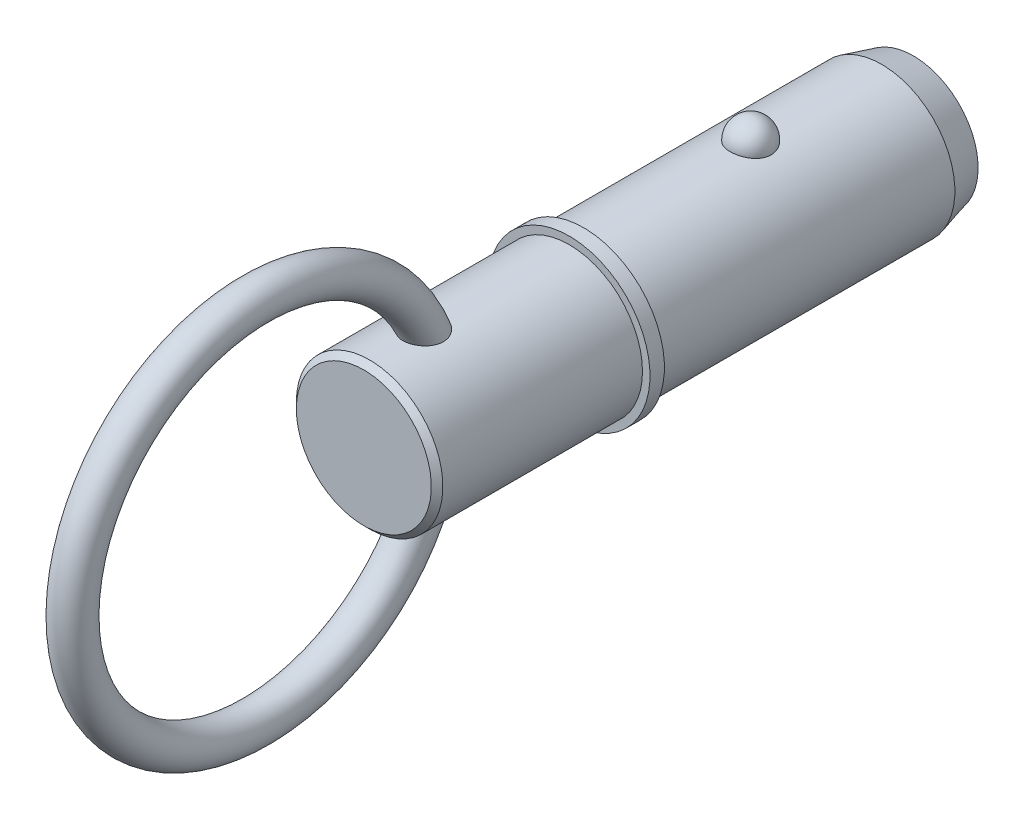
ISO-10303-21;
HEADER;
FILE_DESCRIPTION(('STEP AP214'),'2;1');
FILE_NAME('part.step','',(''),(''),'','','');
FILE_SCHEMA(('AUTOMOTIVE_DESIGN { 1 0 10303 214 1 1 1 1 }'));
ENDSEC;
DATA;
#1=APPLICATION_CONTEXT('core data for automotive mechanical design processes');
#2=APPLICATION_PROTOCOL_DEFINITION('international standard','automotive_design',2000,#1);
#3=PRODUCT_CONTEXT('',#1,'mechanical');
#4=PRODUCT('Part','Part','',(#3));
#5=PRODUCT_RELATED_PRODUCT_CATEGORY('part','',(#4));
#6=PRODUCT_DEFINITION_FORMATION('','',#4);
#7=PRODUCT_DEFINITION_CONTEXT('part definition',#1,'design');
#8=PRODUCT_DEFINITION('design','',#6,#7);
#9=PRODUCT_DEFINITION_SHAPE('','',#8);
#10=(LENGTH_UNIT() NAMED_UNIT(*) SI_UNIT(.MILLI.,.METRE.));
#11=(NAMED_UNIT(*) PLANE_ANGLE_UNIT() SI_UNIT($,.RADIAN.));
#12=(NAMED_UNIT(*) SI_UNIT($,.STERADIAN.) SOLID_ANGLE_UNIT());
#13=UNCERTAINTY_MEASURE_WITH_UNIT(LENGTH_MEASURE(1.E-05),#10,'distance_accuracy_value','');
#14=(GEOMETRIC_REPRESENTATION_CONTEXT(3) GLOBAL_UNCERTAINTY_ASSIGNED_CONTEXT((#13)) GLOBAL_UNIT_ASSIGNED_CONTEXT((#10,
#11,#12)) REPRESENTATION_CONTEXT('',''));
#15=CARTESIAN_POINT('',(0.,0.,0.));
#16=DIRECTION('',(0.,0.,1.));
#17=DIRECTION('',(1.,0.,0.));
#18=AXIS2_PLACEMENT_3D('',#15,#16,#17);
#19=CARTESIAN_POINT('',(0.,0.,25.4));
#20=DIRECTION('',(0.,0.,-1.));
#21=DIRECTION('',(-1.,0.,0.));
#22=AXIS2_PLACEMENT_3D('',#19,#20,#21);
#23=CYLINDRICAL_SURFACE('',#22,12.7);
#24=CARTESIAN_POINT('',(3.52486003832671,12.2010393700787,-3.56));
#25=CARTESIAN_POINT('',(3.52485671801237,12.2010422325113,-3.3610062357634));
#26=CARTESIAN_POINT('',(3.50863187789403,12.2057632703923,-3.16197042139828));
#27=CARTESIAN_POINT('',(3.4441205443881,12.2241207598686,-2.76953945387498));
#28=CARTESIAN_POINT('',(3.39582213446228,12.2377605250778,-2.57614642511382));
#29=CARTESIAN_POINT('',(3.26839193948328,12.2724057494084,-2.20059799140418));
#30=CARTESIAN_POINT('',(3.18927369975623,12.2934079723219,-2.01843769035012));
#31=CARTESIAN_POINT('',(3.00217139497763,12.3404306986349,-1.6703228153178));
#32=CARTESIAN_POINT('',(2.89418796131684,12.3664510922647,-1.50436788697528));
#33=CARTESIAN_POINT('',(2.65144862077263,12.4207616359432,-1.19241975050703));
#34=CARTESIAN_POINT('',(2.51656310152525,12.4490623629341,-1.04652919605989));
#35=CARTESIAN_POINT('',(2.22383249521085,12.5046678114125,-0.779711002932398));
#36=CARTESIAN_POINT('',(2.0659873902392,12.5319725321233,-0.658783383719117));
#37=CARTESIAN_POINT('',(1.73204520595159,12.5824645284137,-0.445586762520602));
#38=CARTESIAN_POINT('',(1.55600183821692,12.6056634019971,-0.353236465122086));
#39=CARTESIAN_POINT('',(1.19021695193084,12.6454411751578,-0.199381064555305));
#40=CARTESIAN_POINT('',(1.00047694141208,12.6620208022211,-0.137872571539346));
#41=CARTESIAN_POINT('',(0.616329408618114,12.6864692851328,-0.0483191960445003));
#42=CARTESIAN_POINT('',(0.422067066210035,12.6944893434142,-0.0196927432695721));
#43=CARTESIAN_POINT('',(0.0313259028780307,12.7014637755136,0.00524116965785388));
#44=CARTESIAN_POINT('',(-0.165152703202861,12.7004190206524,0.00155173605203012));
#45=CARTESIAN_POINT('',(-0.551780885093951,12.6894611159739,-0.0377454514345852));
#46=CARTESIAN_POINT('',(-0.74198078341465,12.6796749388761,-0.0728962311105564));
#47=CARTESIAN_POINT('',(-1.11361063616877,12.6524544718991,-0.173489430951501));
#48=CARTESIAN_POINT('',(-1.29504043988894,12.6350200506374,-0.238932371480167));
#49=CARTESIAN_POINT('',(-1.64521311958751,12.5942270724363,-0.398772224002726));
#50=CARTESIAN_POINT('',(-1.81387645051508,12.5708347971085,-0.493334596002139));
#51=CARTESIAN_POINT('',(-2.13292959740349,12.5206522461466,-0.708731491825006));
#52=CARTESIAN_POINT('',(-2.28331755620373,12.4938616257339,-0.829568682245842));
#53=CARTESIAN_POINT('',(-2.56470285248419,12.4391828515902,-1.0968714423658));
#54=CARTESIAN_POINT('',(-2.69527522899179,12.4112835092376,-1.24378221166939));
#55=CARTESIAN_POINT('',(-2.93023079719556,12.3579248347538,-1.55763192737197));
#56=CARTESIAN_POINT('',(-3.03461212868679,12.3324656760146,-1.72457229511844));
#57=CARTESIAN_POINT('',(-3.21564423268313,12.2865167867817,-2.07598316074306));
#58=CARTESIAN_POINT('',(-3.29196222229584,12.2660875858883,-2.26063321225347));
#59=CARTESIAN_POINT('',(-3.41323771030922,12.2328979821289,-2.64061334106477));
#60=CARTESIAN_POINT('',(-3.45819611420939,12.2201373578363,-2.83594310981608));
#61=CARTESIAN_POINT('',(-3.51550038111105,12.2037762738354,-3.2308649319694));
#62=CARTESIAN_POINT('',(-3.5279827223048,12.200137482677,-3.43043558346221));
#63=CARTESIAN_POINT('',(-3.52041430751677,12.2023234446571,-3.8289025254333));
#64=CARTESIAN_POINT('',(-3.50036443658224,12.2081479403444,-4.02779883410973));
#65=CARTESIAN_POINT('',(-3.42842010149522,12.2285446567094,-4.41824213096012));
#66=CARTESIAN_POINT('',(-3.37668525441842,12.243073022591,-4.6098208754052));
#67=CARTESIAN_POINT('',(-3.24279085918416,12.2792134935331,-4.98132360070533));
#68=CARTESIAN_POINT('',(-3.16063009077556,12.300825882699,-5.16124711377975));
#69=CARTESIAN_POINT('',(-2.96738224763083,12.3488691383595,-5.50542856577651));
#70=CARTESIAN_POINT('',(-2.85613997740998,12.3753256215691,-5.66959579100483));
#71=CARTESIAN_POINT('',(-2.60773241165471,12.4300386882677,-5.97665065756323));
#72=CARTESIAN_POINT('',(-2.47056612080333,12.458295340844,-6.11953748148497));
#73=CARTESIAN_POINT('',(-2.17327999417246,12.5135827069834,-6.38059312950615));
#74=CARTESIAN_POINT('',(-2.01307652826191,12.5406084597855,-6.49866785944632));
#75=CARTESIAN_POINT('',(-1.67442544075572,12.5902954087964,-6.70609314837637));
#76=CARTESIAN_POINT('',(-1.49597909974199,12.6129569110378,-6.79544572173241));
#77=CARTESIAN_POINT('',(-1.12819666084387,12.6511224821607,-6.94192787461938));
#78=CARTESIAN_POINT('',(-0.93902400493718,12.666712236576,-6.99944518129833));
#79=CARTESIAN_POINT('',(-0.553267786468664,12.6894125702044,-7.08227444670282));
#80=CARTESIAN_POINT('',(-0.356685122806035,12.6965241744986,-7.10759029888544));
#81=CARTESIAN_POINT('',(0.0343320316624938,12.7014305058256,-7.12510946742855));
#82=CARTESIAN_POINT('',(0.228736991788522,12.6993986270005,-7.11792901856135));
#83=CARTESIAN_POINT('',(0.613493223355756,12.6866339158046,-7.07206766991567));
#84=CARTESIAN_POINT('',(0.803844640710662,12.6759013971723,-7.03338790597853));
#85=CARTESIAN_POINT('',(1.17440741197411,12.6469443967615,-6.925834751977));
#86=CARTESIAN_POINT('',(1.35465462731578,12.6287486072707,-6.85707692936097));
#87=CARTESIAN_POINT('',(1.70092526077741,12.5867908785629,-6.69128257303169));
#88=CARTESIAN_POINT('',(1.86694777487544,12.5630285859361,-6.59424424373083));
#89=CARTESIAN_POINT('',(2.18289085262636,12.5120350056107,-6.3727748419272));
#90=CARTESIAN_POINT('',(2.33252391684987,12.4847559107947,-6.24794475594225));
#91=CARTESIAN_POINT('',(2.60889724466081,12.4299457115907,-5.97511730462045));
#92=CARTESIAN_POINT('',(2.73563353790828,12.4024145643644,-5.82711592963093));
#93=CARTESIAN_POINT('',(2.96505559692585,12.3495984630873,-5.5091226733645));
#94=CARTESIAN_POINT('',(3.06728335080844,12.3243610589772,-5.33879227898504));
#95=CARTESIAN_POINT('',(3.24218794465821,12.2795120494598,-4.98295005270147));
#96=CARTESIAN_POINT('',(3.31487538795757,12.2598984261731,-4.79744369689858));
#97=CARTESIAN_POINT('',(3.42255689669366,12.2302435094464,-4.43775244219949));
#98=CARTESIAN_POINT('',(3.46085292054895,12.2193780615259,-4.264615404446));
#99=CARTESIAN_POINT('',(3.5120056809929,12.2047747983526,-3.9143299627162));
#100=CARTESIAN_POINT('',(3.52486299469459,12.2010368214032,-3.73718164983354));
#101=CARTESIAN_POINT('',(3.52486003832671,12.2010393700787,-3.56));
#102=B_SPLINE_CURVE_WITH_KNOTS('',3,(#24,#25,#26,#27,#28,#29,#30,#31,#32,#33,#34,#35,#36,#37,
#38,#39,#40,#41,#42,#43,#44,#45,#46,#47,#48,#49,#50,#51,#52,#53,#54,#55,#56,#57,#58,#59,#60,#61,
#62,#63,#64,#65,#66,#67,#68,#69,#70,#71,#72,#73,#74,#75,#76,#77,#78,#79,#80,#81,#82,#83,#84,#85,
#86,#87,#88,#89,#90,#91,#92,#93,#94,#95,#96,#97,#98,#99,#100,#101),.UNSPECIFIED.,.T.,.F.,(4,2,2,
2,2,2,2,2,2,2,2,2,2,2,2,2,2,2,2,2,2,2,2,2,2,2,2,2,2,2,2,2,2,2,2,2,2,2,4),(0.,0.596344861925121,
1.19291141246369,1.78921606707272,2.38550767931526,2.98474477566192,3.58398233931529,
4.18149920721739,4.77895038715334,5.36566361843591,5.95232045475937,6.53059198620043,
7.10887345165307,7.6905033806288,8.27219236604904,8.86498552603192,9.45782077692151,
10.0574751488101,10.6571122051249,11.2542252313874,11.8513220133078,12.4454353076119,
13.0395724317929,13.636947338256,14.2343451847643,14.8339691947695,15.4335511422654,
16.0256602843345,16.6176978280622,17.1985559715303,17.7793931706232,18.3580179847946,
18.9366795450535,19.5242567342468,20.1119357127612,20.7098642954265,21.3075780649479,
21.8385683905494,22.3695466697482),.UNSPECIFIED.);
#103=CARTESIAN_POINT('',(3.52486003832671,12.2010393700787,-3.56));
#104=VERTEX_POINT('',#103);
#105=EDGE_CURVE('E103',#104,#104,#102,.T.);
#106=ORIENTED_EDGE('',*,*,#105,.T.);
#107=EDGE_LOOP('',(#106));
#108=FACE_BOUND('',#107,.T.);
#109=CARTESIAN_POINT('',(0.,0.,-26.2499999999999));
#110=DIRECTION('',(0.,0.,-1.));
#111=DIRECTION('',(-1.,0.,0.));
#112=AXIS2_PLACEMENT_3D('',#109,#110,#111);
#113=CIRCLE('',#112,12.7);
#114=CARTESIAN_POINT('',(-12.7,0.,-26.2499999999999));
#115=VERTEX_POINT('',#114);
#116=EDGE_CURVE('E111',#115,#115,#113,.F.);
#117=ORIENTED_EDGE('',*,*,#116,.T.);
#118=EDGE_LOOP('',(#117));
#119=FACE_BOUND('',#118,.T.);
#120=CARTESIAN_POINT('',(0.,0.,25.4));
#121=DIRECTION('',(0.,0.,1.));
#122=DIRECTION('',(1.,0.,0.));
#123=AXIS2_PLACEMENT_3D('',#120,#121,#122);
#124=CIRCLE('',#123,12.7);
#125=CARTESIAN_POINT('',(12.7,0.,25.4));
#126=VERTEX_POINT('',#125);
#127=EDGE_CURVE('E109',#126,#126,#124,.T.);
#128=ORIENTED_EDGE('',*,*,#127,.F.);
#129=EDGE_LOOP('',(#128));
#130=FACE_BOUND('',#129,.T.);
#131=ADVANCED_FACE('F39',(#108,#119,#130),#23,.T.);
#132=CARTESIAN_POINT('',(0.,0.,-31.75));
#133=DIRECTION('',(0.,0.,-1.));
#134=DIRECTION('',(-1.,0.,0.));
#135=AXIS2_PLACEMENT_3D('',#132,#133,#134);
#136=PLANE('',#135);
#137=CARTESIAN_POINT('',(0.,0.,-31.75));
#138=DIRECTION('',(0.,0.,-1.));
#139=DIRECTION('',(-1.,0.,0.));
#140=AXIS2_PLACEMENT_3D('',#137,#138,#139);
#141=CIRCLE('',#140,11.2262794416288);
#142=CARTESIAN_POINT('',(-11.2262794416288,0.,-31.75));
#143=VERTEX_POINT('',#142);
#144=EDGE_CURVE('E142',#143,#143,#141,.T.);
#145=ORIENTED_EDGE('',*,*,#144,.T.);
#146=EDGE_LOOP('',(#145));
#147=FACE_BOUND('',#146,.T.);
#148=ADVANCED_FACE('F89',(#147),#136,.T.);
#149=CARTESIAN_POINT('',(0.,0.,-31.75));
#150=DIRECTION('',(0.,0.,1.));
#151=DIRECTION('',(1.,0.,0.));
#152=AXIS2_PLACEMENT_3D('',#149,#150,#151);
#153=CONICAL_SURFACE('',#152,11.2262794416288,0.261799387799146);
#154=ORIENTED_EDGE('',*,*,#116,.F.);
#155=EDGE_LOOP('',(#154));
#156=FACE_BOUND('',#155,.T.);
#157=ORIENTED_EDGE('',*,*,#144,.F.);
#158=EDGE_LOOP('',(#157));
#159=FACE_BOUND('',#158,.T.);
#160=ADVANCED_FACE('F95',(#156,#159),#153,.T.);
#161=CARTESIAN_POINT('',(0.,12.7,-3.56));
#162=DIRECTION('',(0.,1.,0.));
#163=DIRECTION('',(0.,0.,1.));
#164=AXIS2_PLACEMENT_3D('',#161,#162,#163);
#165=SPHERICAL_SURFACE('',#164,3.56);
#166=ORIENTED_EDGE('',*,*,#105,.F.);
#167=EDGE_LOOP('',(#166));
#168=FACE_BOUND('',#167,.T.);
#169=ADVANCED_FACE('F114',(#168),#165,.T.);
#170=CARTESIAN_POINT('',(0.,0.,25.4));
#171=DIRECTION('',(0.,0.,-1.));
#172=DIRECTION('',(-1.,0.,0.));
#173=AXIS2_PLACEMENT_3D('',#170,#171,#172);
#174=PLANE('',#173);
#175=ORIENTED_EDGE('',*,*,#127,.T.);
#176=EDGE_LOOP('',(#175));
#177=FACE_BOUND('',#176,.T.);
#178=CARTESIAN_POINT('',(0.,0.,25.4));
#179=DIRECTION('',(0.,0.,-1.));
#180=DIRECTION('',(-1.,0.,0.));
#181=AXIS2_PLACEMENT_3D('',#178,#179,#180);
#182=CIRCLE('',#181,14.);
#183=CARTESIAN_POINT('',(-14.,0.,25.4));
#184=VERTEX_POINT('',#183);
#185=EDGE_CURVE('E110',#184,#184,#182,.T.);
#186=ORIENTED_EDGE('',*,*,#185,.T.);
#187=EDGE_LOOP('',(#186));
#188=FACE_BOUND('',#187,.T.);
#189=ADVANCED_FACE('F118',(#177,#188),#174,.T.);
#190=CARTESIAN_POINT('',(0.,0.,33.7287874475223));
#191=DIRECTION('',(0.,0.,-1.));
#192=DIRECTION('',(-1.,0.,0.));
#193=AXIS2_PLACEMENT_3D('',#190,#191,#192);
#194=CYLINDRICAL_SURFACE('',#193,14.);
#195=CARTESIAN_POINT('',(0.,0.,27.9));
#196=DIRECTION('',(0.,0.,-1.));
#197=DIRECTION('',(-1.,0.,0.));
#198=AXIS2_PLACEMENT_3D('',#195,#196,#197);
#199=CIRCLE('',#198,14.);
#200=CARTESIAN_POINT('',(-14.,0.,27.9));
#201=VERTEX_POINT('',#200);
#202=EDGE_CURVE('E135',#201,#201,#199,.T.);
#203=ORIENTED_EDGE('',*,*,#202,.T.);
#204=EDGE_LOOP('',(#203));
#205=FACE_BOUND('',#204,.T.);
#206=ORIENTED_EDGE('',*,*,#185,.F.);
#207=EDGE_LOOP('',(#206));
#208=FACE_BOUND('',#207,.T.);
#209=ADVANCED_FACE('F122',(#205,#208),#194,.T.);
#210=CARTESIAN_POINT('',(0.,14.,27.9));
#211=DIRECTION('',(0.,0.,1.));
#212=DIRECTION('',(1.,0.,0.));
#213=AXIS2_PLACEMENT_3D('',#210,#211,#212);
#214=PLANE('',#213);
#215=CARTESIAN_POINT('',(0.,0.,27.9));
#216=DIRECTION('',(0.,0.,1.));
#217=DIRECTION('',(1.,0.,0.));
#218=AXIS2_PLACEMENT_3D('',#215,#216,#217);
#219=CIRCLE('',#218,12.7);
#220=CARTESIAN_POINT('',(12.7,0.,27.9));
#221=VERTEX_POINT('',#220);
#222=EDGE_CURVE('E113',#221,#221,#219,.T.);
#223=ORIENTED_EDGE('',*,*,#222,.F.);
#224=EDGE_LOOP('',(#223));
#225=FACE_BOUND('',#224,.T.);
#226=ORIENTED_EDGE('',*,*,#202,.F.);
#227=EDGE_LOOP('',(#226));
#228=FACE_BOUND('',#227,.T.);
#229=ADVANCED_FACE('F86',(#225,#228),#214,.T.);
#230=CARTESIAN_POINT('',(0.,0.,63.5));
#231=DIRECTION('',(0.,0.,-1.));
#232=DIRECTION('',(-1.,0.,0.));
#233=AXIS2_PLACEMENT_3D('',#230,#231,#232);
#234=CYLINDRICAL_SURFACE('',#233,12.7);
#235=CARTESIAN_POINT('',(-1.22892607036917,-12.6404011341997,49.8711939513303));
#236=CARTESIAN_POINT('',(-1.06119922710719,-12.6567092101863,49.8040042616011));
#237=CARTESIAN_POINT('',(-0.88766380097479,-12.6701810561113,49.7507925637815));
#238=CARTESIAN_POINT('',(-0.533823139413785,-12.6900116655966,49.6734192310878));
#239=CARTESIAN_POINT('',(-0.353518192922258,-12.6963707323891,49.6492563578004));
#240=CARTESIAN_POINT('',(0.00871153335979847,-12.7012887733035,49.6305190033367));
#241=CARTESIAN_POINT('',(0.190636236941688,-12.699848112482,49.6359431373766));
#242=CARTESIAN_POINT('',(0.550971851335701,-12.6893231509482,49.6762551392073));
#243=CARTESIAN_POINT('',(0.729382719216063,-12.6802387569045,49.7111433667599));
#244=CARTESIAN_POINT('',(1.0777168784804,-12.6553960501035,49.8096598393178));
#245=CARTESIAN_POINT('',(1.24763507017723,-12.6396337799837,49.873305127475));
#246=CARTESIAN_POINT('',(1.57398922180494,-12.6031560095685,50.0278916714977));
#247=CARTESIAN_POINT('',(1.73042571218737,-12.5824407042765,50.1188318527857));
#248=CARTESIAN_POINT('',(2.02464767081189,-12.5384554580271,50.3253206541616));
#249=CARTESIAN_POINT('',(2.16251370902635,-12.5151974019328,50.4407569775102));
#250=CARTESIAN_POINT('',(2.41652917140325,-12.4686447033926,50.6934261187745));
#251=CARTESIAN_POINT('',(2.53268123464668,-12.4453500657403,50.830656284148));
#252=CARTESIAN_POINT('',(2.7397169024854,-12.4014166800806,51.1222617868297));
#253=CARTESIAN_POINT('',(2.83072997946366,-12.3807646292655,51.2765433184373));
#254=CARTESIAN_POINT('',(2.98642630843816,-12.3441356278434,51.598338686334));
#255=CARTESIAN_POINT('',(3.05110876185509,-12.3281588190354,51.7658529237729));
#256=CARTESIAN_POINT('',(3.1545033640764,-12.3021148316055,52.1127059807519));
#257=CARTESIAN_POINT('',(3.19268116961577,-12.2921697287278,52.2922122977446));
#258=CARTESIAN_POINT('',(3.24150148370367,-12.2793848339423,52.6551447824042));
#259=CARTESIAN_POINT('',(3.25213515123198,-12.2765473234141,52.8385721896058));
#260=CARTESIAN_POINT('',(3.24696781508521,-12.2779158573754,53.2188932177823));
#261=CARTESIAN_POINT('',(3.22910261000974,-12.2826719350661,53.4157539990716));
#262=CARTESIAN_POINT('',(3.16504953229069,-12.2993299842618,53.8044791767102));
#263=CARTESIAN_POINT('',(3.11884966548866,-12.3112349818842,53.9963414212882));
#264=CARTESIAN_POINT('',(2.99323123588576,-12.3424162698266,54.3928913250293));
#265=CARTESIAN_POINT('',(2.91059577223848,-12.3623844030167,54.5965057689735));
#266=CARTESIAN_POINT('',(2.71447440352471,-12.4069229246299,54.9881909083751));
#267=CARTESIAN_POINT('',(2.60094970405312,-12.431499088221,55.1762416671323));
#268=CARTESIAN_POINT('',(2.40499526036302,-12.4703951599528,55.4474701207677));
#269=CARTESIAN_POINT('',(2.33301847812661,-12.4841083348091,55.5384072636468));
#270=CARTESIAN_POINT('',(2.18106597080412,-12.5115521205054,55.7133206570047));
#271=CARTESIAN_POINT('',(2.10108885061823,-12.5252827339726,55.7972956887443));
#272=CARTESIAN_POINT('',(1.84973962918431,-12.5657115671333,56.0367795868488));
#273=CARTESIAN_POINT('',(1.6664677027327,-12.5917488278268,56.1805264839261));
#274=CARTESIAN_POINT('',(1.33551340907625,-12.6303067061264,56.3858562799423));
#275=CARTESIAN_POINT('',(1.19512135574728,-12.6444898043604,56.4590224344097));
#276=CARTESIAN_POINT('',(0.903945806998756,-12.6686276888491,56.5815868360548));
#277=CARTESIAN_POINT('',(0.753173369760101,-12.6785868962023,56.6310099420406));
#278=CARTESIAN_POINT('',(0.444090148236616,-12.6931800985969,56.7029423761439));
#279=CARTESIAN_POINT('',(0.28574123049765,-12.6977833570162,56.7252963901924));
#280=CARTESIAN_POINT('',(-0.0324491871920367,-12.700953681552,56.7407247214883));
#281=CARTESIAN_POINT('',(-0.192290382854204,-12.6995219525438,56.7338048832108));
#282=CARTESIAN_POINT('',(-0.493822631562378,-12.6912132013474,56.6932090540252));
#283=CARTESIAN_POINT('',(-0.635865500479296,-12.6848307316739,56.6619622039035));
#284=CARTESIAN_POINT('',(-0.913041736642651,-12.6678986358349,56.5777216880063));
#285=CARTESIAN_POINT('',(-1.04817349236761,-12.6573480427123,56.5247229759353));
#286=CARTESIAN_POINT('',(-1.31637898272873,-12.6323524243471,56.3962339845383));
#287=CARTESIAN_POINT('',(-1.44890088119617,-12.6177203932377,56.3196381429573));
#288=CARTESIAN_POINT('',(-1.70162176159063,-12.5861326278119,56.1487430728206));
#289=CARTESIAN_POINT('',(-1.82181486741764,-12.569175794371,56.0544354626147));
#290=CARTESIAN_POINT('',(-2.06961284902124,-12.5309682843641,55.8326655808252));
#291=CARTESIAN_POINT('',(-2.19457628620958,-12.5094982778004,55.7022933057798));
#292=CARTESIAN_POINT('',(-2.42503767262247,-12.4668738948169,55.4253083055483));
#293=CARTESIAN_POINT('',(-2.53052086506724,-12.4457197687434,55.2786834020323));
#294=CARTESIAN_POINT('',(-2.7396115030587,-12.4015349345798,54.9430656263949));
#295=CARTESIAN_POINT('',(-2.83895917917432,-12.3789253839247,54.7513469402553));
#296=CARTESIAN_POINT('',(-3.00725804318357,-12.3391195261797,54.3544056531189));
#297=CARTESIAN_POINT('',(-3.07618857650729,-12.3219268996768,54.1491739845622));
#298=CARTESIAN_POINT('',(-3.18528660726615,-12.2942052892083,53.7137546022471));
#299=CARTESIAN_POINT('',(-3.22287145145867,-12.2842816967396,53.4828554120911));
#300=CARTESIAN_POINT('',(-3.24821271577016,-12.2775854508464,53.1343510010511));
#301=CARTESIAN_POINT('',(-3.2514823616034,-12.276719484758,53.0177778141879));
#302=CARTESIAN_POINT('',(-3.24729041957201,-12.2778310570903,52.7848590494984));
#303=CARTESIAN_POINT('',(-3.23983534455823,-12.2798068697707,52.668513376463));
#304=CARTESIAN_POINT('',(-3.21488959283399,-12.286359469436,52.4462276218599));
#305=CARTESIAN_POINT('',(-3.19823165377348,-12.2907201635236,52.3401869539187));
#306=CARTESIAN_POINT('',(-3.15537465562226,-12.3017926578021,52.1302225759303));
#307=CARTESIAN_POINT('',(-3.12918076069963,-12.3085031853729,52.0262977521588));
#308=CARTESIAN_POINT('',(-3.06721568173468,-12.3240904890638,51.8215537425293));
#309=CARTESIAN_POINT('',(-3.03144854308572,-12.3329663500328,51.7207332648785));
#310=CARTESIAN_POINT('',(-2.95042598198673,-12.3525998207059,51.5231715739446));
#311=CARTESIAN_POINT('',(-2.90517160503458,-12.3633572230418,51.4264299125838));
#312=CARTESIAN_POINT('',(-2.81116315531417,-12.3850478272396,51.2488579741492));
#313=CARTESIAN_POINT('',(-2.76340897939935,-12.3958187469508,51.1674768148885));
#314=CARTESIAN_POINT('',(-2.66091958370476,-12.4182228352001,51.0093176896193));
#315=CARTESIAN_POINT('',(-2.60618212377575,-12.4298562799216,50.9325412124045));
#316=CARTESIAN_POINT('',(-2.49013138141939,-12.4536239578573,50.7842781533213));
#317=CARTESIAN_POINT('',(-2.42882150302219,-12.4657579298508,50.7127888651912));
#318=CARTESIAN_POINT('',(-2.30002146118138,-12.4901640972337,50.5755874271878));
#319=CARTESIAN_POINT('',(-2.23252894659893,-12.5024363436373,50.5098774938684));
#320=CARTESIAN_POINT('',(-2.09370795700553,-12.5264205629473,50.3863775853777));
#321=CARTESIAN_POINT('',(-2.02252382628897,-12.5381388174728,50.3284267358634));
#322=CARTESIAN_POINT('',(-1.87531735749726,-12.5610012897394,50.21889123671));
#323=CARTESIAN_POINT('',(-1.79929316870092,-12.5721452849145,50.1673090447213));
#324=CARTESIAN_POINT('',(-1.56485282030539,-12.6042047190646,50.0227065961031));
#325=CARTESIAN_POINT('',(-1.39990754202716,-12.6237766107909,49.9396874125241));
#326=CARTESIAN_POINT('',(-1.22892607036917,-12.6404011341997,49.8711939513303));
#327=B_SPLINE_CURVE_WITH_KNOTS('',3,(#235,#236,#237,#238,#239,#240,#241,#242,#243,#244,#245,
#246,#247,#248,#249,#250,#251,#252,#253,#254,#255,#256,#257,#258,#259,#260,#261,#262,#263,#264,
#265,#266,#267,#268,#269,#270,#271,#272,#273,#274,#275,#276,#277,#278,#279,#280,#281,#282,#283,
#284,#285,#286,#287,#288,#289,#290,#291,#292,#293,#294,#295,#296,#297,#298,#299,#300,#301,#302,
#303,#304,#305,#306,#307,#308,#309,#310,#311,#312,#313,#314,#315,#316,#317,#318,#319,#320,#321,
#322,#323,#324,#325,#326),.UNSPECIFIED.,.T.,.F.,(4,2,2,2,2,2,2,2,2,2,2,2,2,2,2,2,2,2,2,2,2,2,2,
2,2,2,2,2,2,2,2,2,2,2,2,2,2,2,2,2,2,2,2,2,2,4),(0.,0.543509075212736,1.08699497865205,
1.63045544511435,2.17392254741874,2.71771216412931,3.26148037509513,3.80280767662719,
4.34406914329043,4.8824886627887,5.42092451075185,5.96992270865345,6.51909710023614,
7.10988630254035,7.70092576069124,8.36013748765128,9.02018098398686,9.37009147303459,
9.72006308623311,10.4175255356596,10.8925536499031,11.3670833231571,11.844322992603,
12.3214673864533,12.7562647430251,13.1911630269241,13.6507378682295,14.1105307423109,
14.6541210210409,15.198121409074,15.8467121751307,16.4957426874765,17.1940750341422,
17.5435132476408,17.8927393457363,18.2145822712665,18.536251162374,18.8577843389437,
19.1792821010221,19.4638320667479,19.7484735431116,20.0329683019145,20.3175717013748,
20.5948148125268,20.8721645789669,21.4262200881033),.UNSPECIFIED.);
#328=CARTESIAN_POINT('',(-1.22892607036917,-12.6404011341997,49.8711939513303));
#329=VERTEX_POINT('',#328);
#330=EDGE_CURVE('E10',#329,#329,#327,.T.);
#331=ORIENTED_EDGE('',*,*,#330,.F.);
#332=EDGE_LOOP('',(#331));
#333=FACE_BOUND('',#332,.T.);
#334=CARTESIAN_POINT('',(-1.22892607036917,12.6404011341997,49.8711939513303));
#335=CARTESIAN_POINT('',(-1.39512541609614,12.624240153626,49.93776712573));
#336=CARTESIAN_POINT('',(-1.55582432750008,12.6052778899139,50.0181538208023));
#337=CARTESIAN_POINT('',(-1.86136954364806,12.5638060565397,50.2046587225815));
#338=CARTESIAN_POINT('',(-2.00617769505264,12.5412882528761,50.3108369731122));
#339=CARTESIAN_POINT('',(-2.27547906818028,12.4952333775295,50.5461035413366));
#340=CARTESIAN_POINT('',(-2.39998742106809,12.4716970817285,50.6751746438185));
#341=CARTESIAN_POINT('',(-2.62534229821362,12.4262157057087,50.9526236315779));
#342=CARTESIAN_POINT('',(-2.72620384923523,12.4042696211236,51.1009891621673));
#343=CARTESIAN_POINT('',(-2.90197976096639,12.3643304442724,51.4126750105));
#344=CARTESIAN_POINT('',(-2.97691335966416,12.346334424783,51.5759841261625));
#345=CARTESIAN_POINT('',(-3.09983588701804,12.3160482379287,51.9129272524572));
#346=CARTESIAN_POINT('',(-3.14781852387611,12.3037594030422,52.086563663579));
#347=CARTESIAN_POINT('',(-3.21809353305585,12.2855709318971,52.4455239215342));
#348=CARTESIAN_POINT('',(-3.2394350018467,12.2799082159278,52.631044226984));
#349=CARTESIAN_POINT('',(-3.2544382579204,12.2759385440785,53.0032324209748));
#350=CARTESIAN_POINT('',(-3.24809142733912,12.2776338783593,53.189900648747));
#351=CARTESIAN_POINT('',(-3.20755159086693,12.288291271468,53.5775770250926));
#352=CARTESIAN_POINT('',(-3.17081691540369,12.2979162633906,53.778299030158));
#353=CARTESIAN_POINT('',(-3.06845850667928,12.3238513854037,54.1718580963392));
#354=CARTESIAN_POINT('',(-3.00281105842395,12.3401670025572,54.3646885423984));
#355=CARTESIAN_POINT('',(-2.83560995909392,12.3797223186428,54.7594732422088));
#356=CARTESIAN_POINT('',(-2.73085133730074,12.4035339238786,54.9600192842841));
#357=CARTESIAN_POINT('',(-2.48976141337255,12.4541651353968,55.3408130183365));
#358=CARTESIAN_POINT('',(-2.35343772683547,12.4809840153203,55.5210655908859));
#359=CARTESIAN_POINT('',(-2.07683984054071,12.5296806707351,55.8256599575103));
#360=CARTESIAN_POINT('',(-1.94129351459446,12.551613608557,55.9542839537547));
#361=CARTESIAN_POINT('',(-1.65081707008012,12.5931023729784,56.1878364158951));
#362=CARTESIAN_POINT('',(-1.49591505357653,12.6126615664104,56.2927986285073));
#363=CARTESIAN_POINT('',(-1.19690065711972,12.6442092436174,56.4577889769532));
#364=CARTESIAN_POINT('',(-1.05541267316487,12.6569190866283,56.5224184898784));
#365=CARTESIAN_POINT('',(-0.763415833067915,12.6778764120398,56.6276387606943));
#366=CARTESIAN_POINT('',(-0.612913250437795,12.6861269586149,56.6682460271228));
#367=CARTESIAN_POINT('',(-0.306168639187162,12.697239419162,56.7227152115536));
#368=CARTESIAN_POINT('',(-0.149903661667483,12.7000767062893,56.7364549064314));
#369=CARTESIAN_POINT('',(0.162552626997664,12.699920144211,56.7356942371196));
#370=CARTESIAN_POINT('',(0.318743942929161,12.6969267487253,56.721196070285));
#371=CARTESIAN_POINT('',(0.614555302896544,12.6859231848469,56.6672341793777));
#372=CARTESIAN_POINT('',(0.754548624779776,12.6782987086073,56.6296876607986));
#373=CARTESIAN_POINT('',(1.02685044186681,12.6591561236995,56.5337115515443));
#374=CARTESIAN_POINT('',(1.15915690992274,12.6476369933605,56.4752764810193));
#375=CARTESIAN_POINT('',(1.42405861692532,12.6206654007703,56.3349885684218));
#376=CARTESIAN_POINT('',(1.55582877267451,12.604971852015,56.2516353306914));
#377=CARTESIAN_POINT('',(1.80621935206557,12.571537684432,56.0674980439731));
#378=CARTESIAN_POINT('',(1.92483289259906,12.5537960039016,55.9667049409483));
#379=CARTESIAN_POINT('',(2.16936918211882,12.5140714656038,55.7301745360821));
#380=CARTESIAN_POINT('',(2.2923642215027,12.4919255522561,55.5914396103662));
#381=CARTESIAN_POINT('',(2.51762485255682,12.4484835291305,55.2979131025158));
#382=CARTESIAN_POINT('',(2.61987416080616,12.4271880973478,55.1431090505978));
#383=CARTESIAN_POINT('',(2.81956306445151,12.3835520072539,54.7913163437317));
#384=CARTESIAN_POINT('',(2.91268031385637,12.3617361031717,54.591798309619));
#385=CARTESIAN_POINT('',(3.06675738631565,12.3244204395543,54.1798981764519));
#386=CARTESIAN_POINT('',(3.12769905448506,12.3089242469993,53.9675088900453));
#387=CARTESIAN_POINT('',(3.19410612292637,12.2917937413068,53.6377293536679));
#388=CARTESIAN_POINT('',(3.21217746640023,12.2870696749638,53.5229179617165));
#389=CARTESIAN_POINT('',(3.23822570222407,12.2802317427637,53.2920954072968));
#390=CARTESIAN_POINT('',(3.24620727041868,12.2781166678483,53.1760848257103));
#391=CARTESIAN_POINT('',(3.25166839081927,12.2766712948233,52.9438104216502));
#392=CARTESIAN_POINT('',(3.24914931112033,12.2773406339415,52.8275466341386));
#393=CARTESIAN_POINT('',(3.23325304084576,12.2815367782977,52.5958693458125));
#394=CARTESIAN_POINT('',(3.2198826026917,12.2850618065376,52.4804553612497));
#395=CARTESIAN_POINT('',(3.18378347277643,12.2944635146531,52.262188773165));
#396=CARTESIAN_POINT('',(3.16203615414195,12.3000921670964,52.1591627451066));
#397=CARTESIAN_POINT('',(3.109310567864,12.3135262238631,51.9556941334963));
#398=CARTESIAN_POINT('',(3.07833729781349,12.3213304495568,51.85525018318));
#399=CARTESIAN_POINT('',(3.00719503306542,12.3388864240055,51.6578823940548));
#400=CARTESIAN_POINT('',(2.9670290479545,12.34863753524,51.5609574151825));
#401=CARTESIAN_POINT('',(2.87766260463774,12.3697681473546,51.3715530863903));
#402=CARTESIAN_POINT('',(2.82846300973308,12.3811474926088,51.279073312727));
#403=CARTESIAN_POINT('',(2.72718770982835,12.4038233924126,51.1092787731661));
#404=CARTESIAN_POINT('',(2.67601025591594,12.4149937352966,51.0314098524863));
#405=CARTESIAN_POINT('',(2.56702778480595,12.4379850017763,50.8805146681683));
#406=CARTESIAN_POINT('',(2.5092205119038,12.4498061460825,50.807490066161));
#407=CARTESIAN_POINT('',(2.38741431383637,12.4737362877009,50.6669157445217));
#408=CARTESIAN_POINT('',(2.32341881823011,12.4858451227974,50.5993630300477));
#409=CARTESIAN_POINT('',(2.18967865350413,12.5099935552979,50.4701830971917));
#410=CARTESIAN_POINT('',(2.11993188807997,12.5220331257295,50.4085580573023));
#411=CARTESIAN_POINT('',(1.90863625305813,12.5565453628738,50.2379714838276));
#412=CARTESIAN_POINT('',(1.75996750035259,12.5784460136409,50.1375080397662));
#413=CARTESIAN_POINT('',(1.44761854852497,12.6182083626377,49.9627484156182));
#414=CARTESIAN_POINT('',(1.28394037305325,12.6360706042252,49.8884487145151));
#415=CARTESIAN_POINT('',(0.945887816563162,12.6658634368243,49.7675372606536));
#416=CARTESIAN_POINT('',(0.771499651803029,12.6777861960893,49.7209620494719));
#417=CARTESIAN_POINT('',(0.417041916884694,12.694390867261,49.6566734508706));
#418=CARTESIAN_POINT('',(0.23696907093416,12.6990685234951,49.6389770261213));
#419=CARTESIAN_POINT('',(-0.124879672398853,12.7006841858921,49.6328291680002));
#420=CARTESIAN_POINT('',(-0.306658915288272,12.6975703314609,49.6445736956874));
#421=CARTESIAN_POINT('',(-0.665297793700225,12.6838264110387,49.6974733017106));
#422=CARTESIAN_POINT('',(-0.84216829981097,12.6732146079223,49.7385569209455));
#423=CARTESIAN_POINT('',(-1.05025519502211,12.6565519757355,49.805394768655));
#424=CARTESIAN_POINT('',(-1.08632235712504,12.6535053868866,49.8176815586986));
#425=CARTESIAN_POINT('',(-1.15798463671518,12.6471484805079,49.8435019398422));
#426=CARTESIAN_POINT('',(-1.19357974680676,12.6438381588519,49.8570355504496));
#427=CARTESIAN_POINT('',(-1.22892607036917,12.6404011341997,49.8711939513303));
#428=B_SPLINE_CURVE_WITH_KNOTS('',3,(#334,#335,#336,#337,#338,#339,#340,#341,#342,#343,#344,
#345,#346,#347,#348,#349,#350,#351,#352,#353,#354,#355,#356,#357,#358,#359,#360,#361,#362,#363,
#364,#365,#366,#367,#368,#369,#370,#371,#372,#373,#374,#375,#376,#377,#378,#379,#380,#381,#382,
#383,#384,#385,#386,#387,#388,#389,#390,#391,#392,#393,#394,#395,#396,#397,#398,#399,#400,#401,
#402,#403,#404,#405,#406,#407,#408,#409,#410,#411,#412,#413,#414,#415,#416,#417,#418,#419,#420,
#421,#422,#423,#424,#425,#426,#427),.UNSPECIFIED.,.T.,.F.,(4,2,2,2,2,2,2,2,2,2,2,2,2,2,2,2,2,2,
2,2,2,2,2,2,2,2,2,2,2,2,2,2,2,2,2,2,2,2,2,2,2,2,2,2,2,2,4),(0.,0.539146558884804,
1.07956050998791,1.61956978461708,2.15923496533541,2.69849886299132,3.23788860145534,
3.79602631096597,4.3543377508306,4.96471598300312,5.57559579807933,6.2550948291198,
6.93443009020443,7.49671429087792,8.05819140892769,8.52445959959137,8.99040698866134,
9.45846913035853,9.92649485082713,10.3600530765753,10.7937251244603,11.2621204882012,
11.7307597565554,12.2888675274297,12.8474116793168,13.5084064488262,14.1697737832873,
14.5183408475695,14.8667463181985,15.2151063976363,15.5632498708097,15.8791508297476,
16.1948809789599,16.5105079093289,16.826104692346,17.1072964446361,17.3885841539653,
17.669716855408,17.9509524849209,18.490448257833,19.0298713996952,19.5700039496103,
20.1104536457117,20.6545101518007,21.1972460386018,21.3119068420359,21.4265694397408),.UNSPECIFIED.);
#429=CARTESIAN_POINT('',(-1.22892607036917,12.6404011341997,49.8711939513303));
#430=VERTEX_POINT('',#429);
#431=EDGE_CURVE('E51',#430,#430,#428,.T.);
#432=ORIENTED_EDGE('',*,*,#431,.F.);
#433=EDGE_LOOP('',(#432));
#434=FACE_BOUND('',#433,.T.);
#435=CARTESIAN_POINT('',(0.,0.,62.5));
#436=DIRECTION('',(0.,0.,-1.));
#437=DIRECTION('',(-1.,0.,0.));
#438=AXIS2_PLACEMENT_3D('',#435,#436,#437);
#439=CIRCLE('',#438,12.7);
#440=CARTESIAN_POINT('',(-12.7,0.,62.5));
#441=VERTEX_POINT('',#440);
#442=EDGE_CURVE('E65',#441,#441,#439,.T.);
#443=ORIENTED_EDGE('',*,*,#442,.T.);
#444=EDGE_LOOP('',(#443));
#445=FACE_BOUND('',#444,.T.);
#446=ORIENTED_EDGE('',*,*,#222,.T.);
#447=EDGE_LOOP('',(#446));
#448=FACE_BOUND('',#447,.T.);
#449=ADVANCED_FACE('F70',(#333,#434,#445,#448),#234,.T.);
#450=CARTESIAN_POINT('',(0.,0.,63.5));
#451=DIRECTION('',(0.,0.,-1.));
#452=DIRECTION('',(-1.,0.,0.));
#453=AXIS2_PLACEMENT_3D('',#450,#451,#452);
#454=PLANE('',#453);
#455=CARTESIAN_POINT('',(0.,0.,63.5));
#456=DIRECTION('',(0.,0.,-1.));
#457=DIRECTION('',(-1.,0.,0.));
#458=AXIS2_PLACEMENT_3D('',#455,#456,#457);
#459=CIRCLE('',#458,11.7);
#460=CARTESIAN_POINT('',(-11.7,0.,63.5));
#461=VERTEX_POINT('',#460);
#462=EDGE_CURVE('E58',#461,#461,#459,.F.);
#463=ORIENTED_EDGE('',*,*,#462,.T.);
#464=EDGE_LOOP('',(#463));
#465=FACE_BOUND('',#464,.T.);
#466=ADVANCED_FACE('F77',(#465),#454,.F.);
#467=CARTESIAN_POINT('',(0.,0.,62.5));
#468=DIRECTION('',(0.,0.,-1.));
#469=DIRECTION('',(-1.,0.,0.));
#470=AXIS2_PLACEMENT_3D('',#467,#468,#469);
#471=CONICAL_SURFACE('',#470,12.7,0.785398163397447);
#472=ORIENTED_EDGE('',*,*,#462,.F.);
#473=EDGE_LOOP('',(#472));
#474=FACE_BOUND('',#473,.T.);
#475=ORIENTED_EDGE('',*,*,#442,.F.);
#476=EDGE_LOOP('',(#475));
#477=FACE_BOUND('',#476,.T.);
#478=ADVANCED_FACE('F41',(#474,#477),#471,.T.);
#479=CARTESIAN_POINT('',(0.,0.,82.25));
#480=DIRECTION('',(1.,0.,0.));
#481=DIRECTION('',(0.,0.,-1.));
#482=AXIS2_PLACEMENT_3D('',#479,#480,#481);
#483=TOROIDAL_SURFACE('',#482,31.75,3.25);
#484=ORIENTED_EDGE('',*,*,#330,.T.);
#485=EDGE_LOOP('',(#484));
#486=FACE_BOUND('',#485,.T.);
#487=ORIENTED_EDGE('',*,*,#431,.T.);
#488=EDGE_LOOP('',(#487));
#489=FACE_BOUND('',#488,.T.);
#490=ADVANCED_FACE('F74',(#486,#489),#483,.T.);
#491=CLOSED_SHELL('',(#131,#148,#160,#169,#189,#209,#229,#449,#466,#478,#490));
#492=MANIFOLD_SOLID_BREP('B2',#491);
#493=ADVANCED_BREP_SHAPE_REPRESENTATION('',(#18,#492),#14);
#494=SHAPE_DEFINITION_REPRESENTATION(#9,#493);
ENDSEC;
END-ISO-10303-21;
